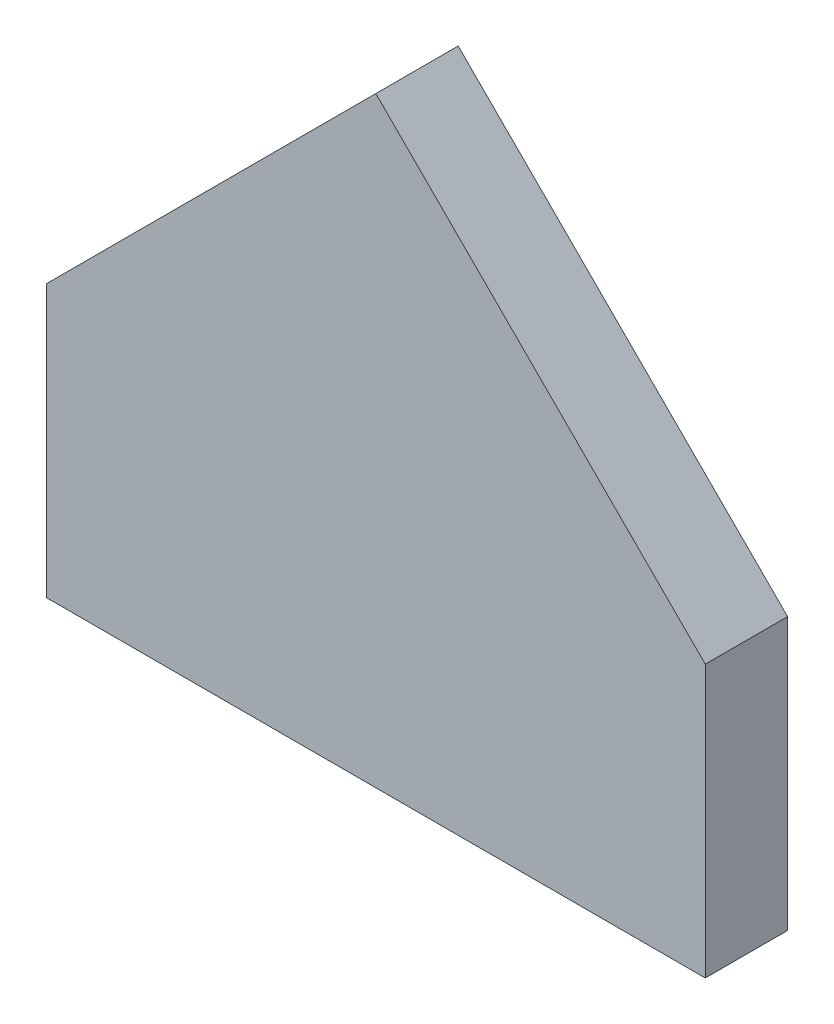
from build123d import *

# Parameters (mm, degrees)
EXTRUSION2_DEPTH = 5


with BuildPart() as part:
    # Esquisse1 → Extrusion2 (new body)
    with BuildSketch(Plane.XY):
        Polygon((0, 0), (40, 0), (40, 16.5), (20, 36.5), (0, 16.5), align=None)
    extrude(amount=EXTRUSION2_DEPTH)


solid = part.part
